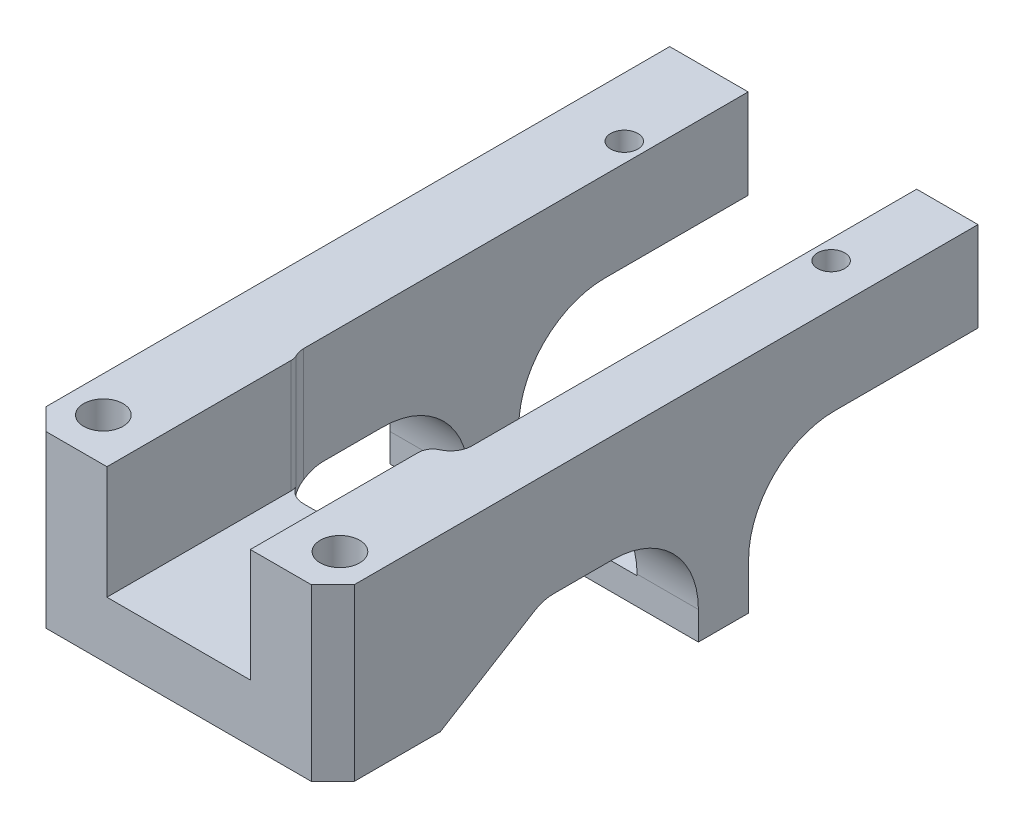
ISO-10303-21;
HEADER;
FILE_DESCRIPTION(('STEP AP214'),'2;1');
FILE_NAME('part.step','',(''),(''),'','','');
FILE_SCHEMA(('AUTOMOTIVE_DESIGN { 1 0 10303 214 1 1 1 1 }'));
ENDSEC;
DATA;
#1=APPLICATION_CONTEXT('core data for automotive mechanical design processes');
#2=APPLICATION_PROTOCOL_DEFINITION('international standard','automotive_design',2000,#1);
#3=PRODUCT_CONTEXT('',#1,'mechanical');
#4=PRODUCT('Part','Part','',(#3));
#5=PRODUCT_RELATED_PRODUCT_CATEGORY('part','',(#4));
#6=PRODUCT_DEFINITION_FORMATION('','',#4);
#7=PRODUCT_DEFINITION_CONTEXT('part definition',#1,'design');
#8=PRODUCT_DEFINITION('design','',#6,#7);
#9=PRODUCT_DEFINITION_SHAPE('','',#8);
#10=(LENGTH_UNIT() NAMED_UNIT(*) SI_UNIT(.MILLI.,.METRE.));
#11=(NAMED_UNIT(*) PLANE_ANGLE_UNIT() SI_UNIT($,.RADIAN.));
#12=(NAMED_UNIT(*) SI_UNIT($,.STERADIAN.) SOLID_ANGLE_UNIT());
#13=UNCERTAINTY_MEASURE_WITH_UNIT(LENGTH_MEASURE(1.E-05),#10,'distance_accuracy_value','');
#14=(GEOMETRIC_REPRESENTATION_CONTEXT(3) GLOBAL_UNCERTAINTY_ASSIGNED_CONTEXT((#13)) GLOBAL_UNIT_ASSIGNED_CONTEXT((#10,
#11,#12)) REPRESENTATION_CONTEXT('',''));
#15=CARTESIAN_POINT('',(0.,0.,0.));
#16=DIRECTION('',(0.,0.,1.));
#17=DIRECTION('',(1.,0.,0.));
#18=AXIS2_PLACEMENT_3D('',#15,#16,#17);
#19=CARTESIAN_POINT('',(15.621,30.9365,-75.395));
#20=DIRECTION('',(0.,1.,0.));
#21=DIRECTION('',(0.,0.,1.));
#22=AXIS2_PLACEMENT_3D('',#19,#20,#21);
#23=CYLINDRICAL_SURFACE('',#22,1.89864999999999);
#24=CARTESIAN_POINT('',(15.621,18.4365,-75.395));
#25=DIRECTION('',(0.,1.,0.));
#26=DIRECTION('',(0.,0.,1.));
#27=AXIS2_PLACEMENT_3D('',#24,#25,#26);
#28=CIRCLE('',#27,1.89864999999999);
#29=CARTESIAN_POINT('',(15.621,18.4365,-73.49635));
#30=VERTEX_POINT('',#29);
#31=EDGE_CURVE('E20',#30,#30,#28,.F.);
#32=ORIENTED_EDGE('',*,*,#31,.T.);
#33=EDGE_LOOP('',(#32));
#34=FACE_BOUND('',#33,.T.);
#35=CARTESIAN_POINT('',(15.621,30.9365,-75.395));
#36=DIRECTION('',(0.,1.,0.));
#37=DIRECTION('',(0.,0.,1.));
#38=AXIS2_PLACEMENT_3D('',#35,#36,#37);
#39=CIRCLE('',#38,1.89864999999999);
#40=CARTESIAN_POINT('',(15.621,30.9365,-73.49635));
#41=VERTEX_POINT('',#40);
#42=EDGE_CURVE('E199',#41,#41,#39,.T.);
#43=ORIENTED_EDGE('',*,*,#42,.T.);
#44=EDGE_LOOP('',(#43));
#45=FACE_BOUND('',#44,.T.);
#46=ADVANCED_FACE('F17',(#34,#45),#23,.F.);
#47=CARTESIAN_POINT('',(10.,-24.8451211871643,-25.));
#48=DIRECTION('',(1.,0.,0.));
#49=DIRECTION('',(0.,0.,-1.));
#50=AXIS2_PLACEMENT_3D('',#47,#48,#49);
#51=PLANE('',#50);
#52=DIRECTION('',(0.,-1.,0.));
#53=VECTOR('',#52,1.);
#54=CARTESIAN_POINT('',(10.,3.73849999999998,-23.4423644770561));
#55=LINE('',#54,#53);
#56=CARTESIAN_POINT('',(10.,15.1705,-23.4423644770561));
#57=VERTEX_POINT('',#56);
#58=CARTESIAN_POINT('',(10.,30.9365,-23.4423644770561));
#59=VERTEX_POINT('',#58);
#60=EDGE_CURVE('E179',#57,#59,#55,.F.);
#61=ORIENTED_EDGE('',*,*,#60,.F.);
#62=DIRECTION('',(0.,0.,1.));
#63=VECTOR('',#62,1.);
#64=CARTESIAN_POINT('',(10.,15.1705,0.));
#65=LINE('',#64,#63);
#66=CARTESIAN_POINT('',(10.,15.1705,0.));
#67=VERTEX_POINT('',#66);
#68=EDGE_CURVE('E205',#67,#57,#65,.F.);
#69=ORIENTED_EDGE('',*,*,#68,.F.);
#70=DIRECTION('',(0.,1.,0.));
#71=VECTOR('',#70,1.);
#72=CARTESIAN_POINT('',(10.,0.,0.));
#73=LINE('',#72,#71);
#74=CARTESIAN_POINT('',(10.,30.9365,0.));
#75=VERTEX_POINT('',#74);
#76=EDGE_CURVE('E183',#67,#75,#73,.T.);
#77=ORIENTED_EDGE('',*,*,#76,.T.);
#78=DIRECTION('',(0.,0.,-1.));
#79=VECTOR('',#78,1.);
#80=CARTESIAN_POINT('',(10.,30.9365,0.));
#81=LINE('',#80,#79);
#82=EDGE_CURVE('E174',#75,#59,#81,.T.);
#83=ORIENTED_EDGE('',*,*,#82,.T.);
#84=EDGE_LOOP('',(#61,#69,#77,#83));
#85=FACE_BOUND('',#84,.T.);
#86=ADVANCED_FACE('F176',(#85),#51,.F.);
#87=CARTESIAN_POINT('',(21.5,0.,-90.));
#88=DIRECTION('',(0.,0.,1.));
#89=DIRECTION('',(1.,0.,0.));
#90=AXIS2_PLACEMENT_3D('',#87,#88,#89);
#91=PLANE('',#90);
#92=DIRECTION('',(0.,1.,0.));
#93=VECTOR('',#92,1.);
#94=CARTESIAN_POINT('',(12.9438,3.73849999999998,-90.));
#95=LINE('',#94,#93);
#96=CARTESIAN_POINT('',(12.9438,18.4365,-90.));
#97=VERTEX_POINT('',#96);
#98=CARTESIAN_POINT('',(12.9438,30.9365,-90.));
#99=VERTEX_POINT('',#98);
#100=EDGE_CURVE('E328',#97,#99,#95,.T.);
#101=ORIENTED_EDGE('',*,*,#100,.T.);
#102=DIRECTION('',(1.,0.,0.));
#103=VECTOR('',#102,1.);
#104=CARTESIAN_POINT('',(21.5,30.9365,-90.));
#105=LINE('',#104,#103);
#106=CARTESIAN_POINT('',(21.5,30.9365,-90.));
#107=VERTEX_POINT('',#106);
#108=EDGE_CURVE('E187',#99,#107,#105,.T.);
#109=ORIENTED_EDGE('',*,*,#108,.T.);
#110=DIRECTION('',(0.,1.,0.));
#111=VECTOR('',#110,1.);
#112=CARTESIAN_POINT('',(21.5,0.,-90.));
#113=LINE('',#112,#111);
#114=CARTESIAN_POINT('',(21.5,18.4365,-90.));
#115=VERTEX_POINT('',#114);
#116=EDGE_CURVE('E408',#107,#115,#113,.F.);
#117=ORIENTED_EDGE('',*,*,#116,.T.);
#118=DIRECTION('',(1.,0.,0.));
#119=VECTOR('',#118,1.);
#120=CARTESIAN_POINT('',(-21.501,18.4365,-90.));
#121=LINE('',#120,#119);
#122=EDGE_CURVE('E188',#115,#97,#121,.F.);
#123=ORIENTED_EDGE('',*,*,#122,.T.);
#124=EDGE_LOOP('',(#101,#109,#117,#123));
#125=FACE_BOUND('',#124,.T.);
#126=ADVANCED_FACE('F674',(#125),#91,.F.);
#127=CARTESIAN_POINT('',(-21.501,18.4365,-90.));
#128=DIRECTION('',(0.,1.,0.));
#129=DIRECTION('',(0.,0.,1.));
#130=AXIS2_PLACEMENT_3D('',#127,#128,#129);
#131=PLANE('',#130);
#132=DIRECTION('',(-1.,0.,0.));
#133=VECTOR('',#132,1.);
#134=CARTESIAN_POINT('',(-21.501,18.4365,-70.));
#135=LINE('',#134,#133);
#136=CARTESIAN_POINT('',(21.5,18.4365,-70.));
#137=VERTEX_POINT('',#136);
#138=CARTESIAN_POINT('',(12.9438,18.4365,-70.));
#139=VERTEX_POINT('',#138);
#140=EDGE_CURVE('E380',#137,#139,#135,.T.);
#141=ORIENTED_EDGE('',*,*,#140,.T.);
#142=DIRECTION('',(0.,0.,-1.));
#143=VECTOR('',#142,1.);
#144=CARTESIAN_POINT('',(12.9438,18.4365,-90.));
#145=LINE('',#144,#143);
#146=EDGE_CURVE('E301',#139,#97,#145,.T.);
#147=ORIENTED_EDGE('',*,*,#146,.T.);
#148=ORIENTED_EDGE('',*,*,#122,.F.);
#149=DIRECTION('',(0.,0.,1.));
#150=VECTOR('',#149,1.);
#151=CARTESIAN_POINT('',(21.5,18.4365,0.));
#152=LINE('',#151,#150);
#153=EDGE_CURVE('E292',#115,#137,#152,.T.);
#154=ORIENTED_EDGE('',*,*,#153,.T.);
#155=EDGE_LOOP('',(#141,#147,#148,#154));
#156=FACE_BOUND('',#155,.T.);
#157=ORIENTED_EDGE('',*,*,#31,.F.);
#158=EDGE_LOOP('',(#157));
#159=FACE_BOUND('',#158,.T.);
#160=ADVANCED_FACE('F679',(#156,#159),#131,.F.);
#161=CARTESIAN_POINT('',(-21.501,15.9365,-29.3625701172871));
#162=DIRECTION('',(0.,1.,0.));
#163=DIRECTION('',(0.,0.,1.));
#164=AXIS2_PLACEMENT_3D('',#161,#162,#163);
#165=PLANE('',#164);
#166=DIRECTION('',(-1.,0.,0.));
#167=VECTOR('',#166,1.);
#168=CARTESIAN_POINT('',(-21.501,15.9365,-30.7678767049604));
#169=LINE('',#168,#167);
#170=CARTESIAN_POINT('',(21.5,15.9365,-30.7678767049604));
#171=VERTEX_POINT('',#170);
#172=CARTESIAN_POINT('',(12.9438,15.9365,-30.7678767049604));
#173=VERTEX_POINT('',#172);
#174=EDGE_CURVE('E281',#171,#173,#169,.T.);
#175=ORIENTED_EDGE('',*,*,#174,.T.);
#176=DIRECTION('',(0.,0.,-1.));
#177=VECTOR('',#176,1.);
#178=CARTESIAN_POINT('',(12.9438,15.9365,-90.));
#179=LINE('',#178,#177);
#180=CARTESIAN_POINT('',(12.9438,15.9365,-39.));
#181=VERTEX_POINT('',#180);
#182=EDGE_CURVE('E404',#173,#181,#179,.T.);
#183=ORIENTED_EDGE('',*,*,#182,.T.);
#184=DIRECTION('',(-1.,0.,0.));
#185=VECTOR('',#184,1.);
#186=CARTESIAN_POINT('',(-21.501,15.9365,-39.));
#187=LINE('',#186,#185);
#188=CARTESIAN_POINT('',(21.5,15.9365,-39.));
#189=VERTEX_POINT('',#188);
#190=EDGE_CURVE('E297',#181,#189,#187,.F.);
#191=ORIENTED_EDGE('',*,*,#190,.T.);
#192=DIRECTION('',(0.,0.,1.));
#193=VECTOR('',#192,1.);
#194=CARTESIAN_POINT('',(21.5,15.9365,0.));
#195=LINE('',#194,#193);
#196=EDGE_CURVE('E289',#189,#171,#195,.T.);
#197=ORIENTED_EDGE('',*,*,#196,.T.);
#198=EDGE_LOOP('',(#175,#183,#191,#197));
#199=FACE_BOUND('',#198,.T.);
#200=ADVANCED_FACE('F583',(#199),#165,.F.);
#201=CARTESIAN_POINT('',(21.5,30.9365,0.));
#202=DIRECTION('',(0.,-1.,0.));
#203=DIRECTION('',(0.,0.,-1.));
#204=AXIS2_PLACEMENT_3D('',#201,#202,#203);
#205=PLANE('',#204);
#206=CARTESIAN_POINT('',(16.5,30.9365,-6.));
#207=DIRECTION('',(0.,1.,0.));
#208=DIRECTION('',(0.,0.,1.));
#209=AXIS2_PLACEMENT_3D('',#206,#207,#208);
#210=CIRCLE('',#209,2.74999999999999);
#211=CARTESIAN_POINT('',(16.5,30.9365,-3.25000000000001));
#212=VERTEX_POINT('',#211);
#213=EDGE_CURVE('E303',#212,#212,#210,.F.);
#214=ORIENTED_EDGE('',*,*,#213,.T.);
#215=EDGE_LOOP('',(#214));
#216=FACE_BOUND('',#215,.T.);
#217=ORIENTED_EDGE('',*,*,#42,.F.);
#218=EDGE_LOOP('',(#217));
#219=FACE_BOUND('',#218,.T.);
#220=DIRECTION('',(-0.707106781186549,0.,0.707106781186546));
#221=VECTOR('',#220,1.);
#222=CARTESIAN_POINT('',(21.5,30.9365,-2.99999999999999));
#223=LINE('',#222,#221);
#224=CARTESIAN_POINT('',(18.5,30.9365,0.));
#225=VERTEX_POINT('',#224);
#226=CARTESIAN_POINT('',(21.5,30.9365,-2.99999999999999));
#227=VERTEX_POINT('',#226);
#228=EDGE_CURVE('E306',#225,#227,#223,.F.);
#229=ORIENTED_EDGE('',*,*,#228,.T.);
#230=DIRECTION('',(0.,0.,1.));
#231=VECTOR('',#230,1.);
#232=CARTESIAN_POINT('',(21.5,30.9365,0.));
#233=LINE('',#232,#231);
#234=EDGE_CURVE('E285',#227,#107,#233,.F.);
#235=ORIENTED_EDGE('',*,*,#234,.T.);
#236=ORIENTED_EDGE('',*,*,#108,.F.);
#237=DIRECTION('',(0.,0.,-1.));
#238=VECTOR('',#237,1.);
#239=CARTESIAN_POINT('',(12.9438,30.9365,-90.));
#240=LINE('',#239,#238);
#241=CARTESIAN_POINT('',(12.9438,30.9365,-28.));
#242=VERTEX_POINT('',#241);
#243=EDGE_CURVE('E330',#99,#242,#240,.F.);
#244=ORIENTED_EDGE('',*,*,#243,.T.);
#245=CARTESIAN_POINT('',(9.94380000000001,30.9365,-28.));
#246=DIRECTION('',(0.,-1.,0.));
#247=DIRECTION('',(0.,0.,-1.));
#248=AXIS2_PLACEMENT_3D('',#245,#246,#247);
#249=CIRCLE('',#248,3.);
#250=CARTESIAN_POINT('',(11.17752,30.9365,-25.2654186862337));
#251=VERTEX_POINT('',#250);
#252=EDGE_CURVE('E196',#242,#251,#249,.T.);
#253=ORIENTED_EDGE('',*,*,#252,.T.);
#254=CARTESIAN_POINT('',(12.,30.9365,-23.4423644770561));
#255=DIRECTION('',(0.,-1.,0.));
#256=DIRECTION('',(0.,0.,-1.));
#257=AXIS2_PLACEMENT_3D('',#254,#255,#256);
#258=CIRCLE('',#257,2.);
#259=EDGE_CURVE('E192',#59,#251,#258,.T.);
#260=ORIENTED_EDGE('',*,*,#259,.F.);
#261=ORIENTED_EDGE('',*,*,#82,.F.);
#262=DIRECTION('',(-1.,0.,0.));
#263=VECTOR('',#262,1.);
#264=CARTESIAN_POINT('',(21.5,30.9365,0.));
#265=LINE('',#264,#263);
#266=EDGE_CURVE('E333',#75,#225,#265,.F.);
#267=ORIENTED_EDGE('',*,*,#266,.T.);
#268=EDGE_LOOP('',(#229,#235,#236,#244,#253,#260,#261,#267));
#269=FACE_BOUND('',#268,.T.);
#270=ADVANCED_FACE('F194',(#216,#219,#269),#205,.F.);
#271=CARTESIAN_POINT('',(12.,3.73849999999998,-23.4423644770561));
#272=DIRECTION('',(0.,-1.,0.));
#273=DIRECTION('',(0.,0.,-1.));
#274=AXIS2_PLACEMENT_3D('',#271,#272,#273);
#275=CYLINDRICAL_SURFACE('',#274,2.);
#276=CARTESIAN_POINT('',(12.,15.1705,-23.4423644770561));
#277=DIRECTION('',(0.,-1.,0.));
#278=DIRECTION('',(0.,0.,-1.));
#279=AXIS2_PLACEMENT_3D('',#276,#277,#278);
#280=CIRCLE('',#279,2.);
#281=CARTESIAN_POINT('',(11.17752,15.1705,-25.2654186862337));
#282=VERTEX_POINT('',#281);
#283=EDGE_CURVE('E203',#57,#282,#280,.T.);
#284=ORIENTED_EDGE('',*,*,#283,.F.);
#285=ORIENTED_EDGE('',*,*,#60,.T.);
#286=ORIENTED_EDGE('',*,*,#259,.T.);
#287=DIRECTION('',(0.,-1.,0.));
#288=VECTOR('',#287,1.);
#289=CARTESIAN_POINT('',(11.17752,3.73849999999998,-25.2654186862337));
#290=LINE('',#289,#288);
#291=EDGE_CURVE('E275',#251,#282,#290,.T.);
#292=ORIENTED_EDGE('',*,*,#291,.T.);
#293=EDGE_LOOP('',(#284,#285,#286,#292));
#294=FACE_BOUND('',#293,.T.);
#295=ADVANCED_FACE('F201',(#294),#275,.T.);
#296=CARTESIAN_POINT('',(-21.501,15.1705,0.));
#297=DIRECTION('',(0.,1.,0.));
#298=DIRECTION('',(0.,0.,1.));
#299=AXIS2_PLACEMENT_3D('',#296,#297,#298);
#300=PLANE('',#299);
#301=CARTESIAN_POINT('',(-7.55619999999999,15.1705,-28.));
#302=DIRECTION('',(0.,-1.,0.));
#303=DIRECTION('',(0.,0.,-1.));
#304=AXIS2_PLACEMENT_3D('',#301,#302,#303);
#305=CIRCLE('',#304,3.);
#306=CARTESIAN_POINT('',(-7.55619999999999,15.1705,-25.));
#307=VERTEX_POINT('',#306);
#308=CARTESIAN_POINT('',(-10.22248,15.1705,-26.6248814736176));
#309=VERTEX_POINT('',#308);
#310=EDGE_CURVE('E269',#307,#309,#305,.T.);
#311=ORIENTED_EDGE('',*,*,#310,.T.);
#312=CARTESIAN_POINT('',(-12.,15.1705,-25.7081357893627));
#313=DIRECTION('',(0.,-1.,0.));
#314=DIRECTION('',(0.,0.,-1.));
#315=AXIS2_PLACEMENT_3D('',#312,#313,#314);
#316=CIRCLE('',#315,2.);
#317=CARTESIAN_POINT('',(-9.99999999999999,15.1705,-25.7081357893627));
#318=VERTEX_POINT('',#317);
#319=EDGE_CURVE('E309',#318,#309,#316,.F.);
#320=ORIENTED_EDGE('',*,*,#319,.F.);
#321=DIRECTION('',(0.,0.,1.));
#322=VECTOR('',#321,1.);
#323=CARTESIAN_POINT('',(-9.99999999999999,15.1705,-25.));
#324=LINE('',#323,#322);
#325=CARTESIAN_POINT('',(-9.99999999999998,15.1705,0.));
#326=VERTEX_POINT('',#325);
#327=EDGE_CURVE('E346',#318,#326,#324,.T.);
#328=ORIENTED_EDGE('',*,*,#327,.T.);
#329=DIRECTION('',(-1.,0.,0.));
#330=VECTOR('',#329,1.);
#331=CARTESIAN_POINT('',(21.5,15.1705,0.));
#332=LINE('',#331,#330);
#333=EDGE_CURVE('E339',#326,#67,#332,.F.);
#334=ORIENTED_EDGE('',*,*,#333,.T.);
#335=ORIENTED_EDGE('',*,*,#68,.T.);
#336=ORIENTED_EDGE('',*,*,#283,.T.);
#337=CARTESIAN_POINT('',(9.94380000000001,15.1705,-28.));
#338=DIRECTION('',(0.,-1.,0.));
#339=DIRECTION('',(0.,0.,-1.));
#340=AXIS2_PLACEMENT_3D('',#337,#338,#339);
#341=CIRCLE('',#340,3.);
#342=CARTESIAN_POINT('',(9.94380000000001,15.1705,-25.));
#343=VERTEX_POINT('',#342);
#344=EDGE_CURVE('E272',#282,#343,#341,.T.);
#345=ORIENTED_EDGE('',*,*,#344,.T.);
#346=DIRECTION('',(1.,0.,0.));
#347=VECTOR('',#346,1.);
#348=CARTESIAN_POINT('',(-10.5562,15.1705,-25.));
#349=LINE('',#348,#347);
#350=EDGE_CURVE('E385',#343,#307,#349,.F.);
#351=ORIENTED_EDGE('',*,*,#350,.T.);
#352=EDGE_LOOP('',(#311,#320,#328,#334,#335,#336,#345,#351));
#353=FACE_BOUND('',#352,.T.);
#354=ADVANCED_FACE('F776',(#353),#300,.T.);
#355=CARTESIAN_POINT('',(-12.,3.73849999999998,-25.7081357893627));
#356=DIRECTION('',(0.,-1.,0.));
#357=DIRECTION('',(0.,0.,-1.));
#358=AXIS2_PLACEMENT_3D('',#355,#356,#357);
#359=CYLINDRICAL_SURFACE('',#358,2.);
#360=CARTESIAN_POINT('',(-12.,30.9365,-25.7081357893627));
#361=DIRECTION('',(0.,-1.,0.));
#362=DIRECTION('',(0.,0.,-1.));
#363=AXIS2_PLACEMENT_3D('',#360,#361,#362);
#364=CIRCLE('',#363,2.);
#365=CARTESIAN_POINT('',(-10.22248,30.9365,-26.6248814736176));
#366=VERTEX_POINT('',#365);
#367=CARTESIAN_POINT('',(-9.99999999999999,30.9365,-25.7081357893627));
#368=VERTEX_POINT('',#367);
#369=EDGE_CURVE('E307',#366,#368,#364,.T.);
#370=ORIENTED_EDGE('',*,*,#369,.T.);
#371=DIRECTION('',(0.,1.,0.));
#372=VECTOR('',#371,1.);
#373=CARTESIAN_POINT('',(-9.99999999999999,-24.8451211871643,-25.7081357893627));
#374=LINE('',#373,#372);
#375=EDGE_CURVE('E348',#368,#318,#374,.F.);
#376=ORIENTED_EDGE('',*,*,#375,.T.);
#377=ORIENTED_EDGE('',*,*,#319,.T.);
#378=DIRECTION('',(0.,-1.,0.));
#379=VECTOR('',#378,1.);
#380=CARTESIAN_POINT('',(-10.22248,3.73849999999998,-26.6248814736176));
#381=LINE('',#380,#379);
#382=EDGE_CURVE('E268',#309,#366,#381,.F.);
#383=ORIENTED_EDGE('',*,*,#382,.T.);
#384=EDGE_LOOP('',(#370,#376,#377,#383));
#385=FACE_BOUND('',#384,.T.);
#386=ADVANCED_FACE('F1020',(#385),#359,.T.);
#387=CARTESIAN_POINT('',(16.5,30.9365,-6.));
#388=DIRECTION('',(0.,1.,0.));
#389=DIRECTION('',(0.,0.,1.));
#390=AXIS2_PLACEMENT_3D('',#387,#388,#389);
#391=CYLINDRICAL_SURFACE('',#390,2.74999999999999);
#392=CARTESIAN_POINT('',(16.5,7.17049999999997,-6.));
#393=DIRECTION('',(0.,1.,0.));
#394=DIRECTION('',(0.,0.,1.));
#395=AXIS2_PLACEMENT_3D('',#392,#393,#394);
#396=CIRCLE('',#395,2.74999999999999);
#397=CARTESIAN_POINT('',(16.5,7.17049999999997,-3.25000000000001));
#398=VERTEX_POINT('',#397);
#399=EDGE_CURVE('E261',#398,#398,#396,.F.);
#400=ORIENTED_EDGE('',*,*,#399,.T.);
#401=EDGE_LOOP('',(#400));
#402=FACE_BOUND('',#401,.T.);
#403=ORIENTED_EDGE('',*,*,#213,.F.);
#404=EDGE_LOOP('',(#403));
#405=FACE_BOUND('',#404,.T.);
#406=ADVANCED_FACE('F1012',(#402,#405),#391,.F.);
#407=CARTESIAN_POINT('',(21.5,0.,-2.99999999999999));
#408=DIRECTION('',(-0.707106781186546,0.,-0.707106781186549));
#409=DIRECTION('',(-0.707106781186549,0.,0.707106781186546));
#410=AXIS2_PLACEMENT_3D('',#407,#408,#409);
#411=PLANE('',#410);
#412=DIRECTION('',(0.,1.,0.));
#413=VECTOR('',#412,1.);
#414=CARTESIAN_POINT('',(18.5,0.,0.));
#415=LINE('',#414,#413);
#416=CARTESIAN_POINT('',(18.5,7.17049999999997,0.));
#417=VERTEX_POINT('',#416);
#418=EDGE_CURVE('E335',#225,#417,#415,.F.);
#419=ORIENTED_EDGE('',*,*,#418,.T.);
#420=DIRECTION('',(0.707106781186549,0.,-0.707106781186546));
#421=VECTOR('',#420,1.);
#422=CARTESIAN_POINT('',(18.5,7.17049999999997,0.));
#423=LINE('',#422,#421);
#424=CARTESIAN_POINT('',(21.5,7.17049999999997,-2.99999999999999));
#425=VERTEX_POINT('',#424);
#426=EDGE_CURVE('E365',#417,#425,#423,.T.);
#427=ORIENTED_EDGE('',*,*,#426,.T.);
#428=DIRECTION('',(0.,1.,0.));
#429=VECTOR('',#428,1.);
#430=CARTESIAN_POINT('',(21.5,0.,-2.99999999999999));
#431=LINE('',#430,#429);
#432=EDGE_CURVE('E368',#425,#227,#431,.T.);
#433=ORIENTED_EDGE('',*,*,#432,.T.);
#434=ORIENTED_EDGE('',*,*,#228,.F.);
#435=EDGE_LOOP('',(#419,#427,#433,#434));
#436=FACE_BOUND('',#435,.T.);
#437=ADVANCED_FACE('F781',(#436),#411,.F.);
#438=CARTESIAN_POINT('',(-9.99999999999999,-24.8451211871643,-25.));
#439=DIRECTION('',(-1.,0.,0.));
#440=DIRECTION('',(0.,0.,1.));
#441=AXIS2_PLACEMENT_3D('',#438,#439,#440);
#442=PLANE('',#441);
#443=ORIENTED_EDGE('',*,*,#375,.F.);
#444=DIRECTION('',(0.,0.,-1.));
#445=VECTOR('',#444,1.);
#446=CARTESIAN_POINT('',(-9.99999999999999,30.9365,0.));
#447=LINE('',#446,#445);
#448=CARTESIAN_POINT('',(-9.99999999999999,30.9365,0.));
#449=VERTEX_POINT('',#448);
#450=EDGE_CURVE('E259',#368,#449,#447,.F.);
#451=ORIENTED_EDGE('',*,*,#450,.T.);
#452=DIRECTION('',(0.,1.,0.));
#453=VECTOR('',#452,1.);
#454=CARTESIAN_POINT('',(-9.99999999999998,0.,0.));
#455=LINE('',#454,#453);
#456=EDGE_CURVE('E344',#449,#326,#455,.F.);
#457=ORIENTED_EDGE('',*,*,#456,.T.);
#458=ORIENTED_EDGE('',*,*,#327,.F.);
#459=EDGE_LOOP('',(#443,#451,#457,#458));
#460=FACE_BOUND('',#459,.T.);
#461=ADVANCED_FACE('F997',(#460),#442,.F.);
#462=CARTESIAN_POINT('',(21.5,0.,0.));
#463=DIRECTION('',(0.,0.,-1.));
#464=DIRECTION('',(-1.,0.,0.));
#465=AXIS2_PLACEMENT_3D('',#462,#463,#464);
#466=PLANE('',#465);
#467=ORIENTED_EDGE('',*,*,#418,.F.);
#468=ORIENTED_EDGE('',*,*,#266,.F.);
#469=ORIENTED_EDGE('',*,*,#76,.F.);
#470=ORIENTED_EDGE('',*,*,#333,.F.);
#471=ORIENTED_EDGE('',*,*,#456,.F.);
#472=DIRECTION('',(1.,0.,0.));
#473=VECTOR('',#472,1.);
#474=CARTESIAN_POINT('',(21.5,30.9365,0.));
#475=LINE('',#474,#473);
#476=CARTESIAN_POINT('',(-18.5,30.9365,0.));
#477=VERTEX_POINT('',#476);
#478=EDGE_CURVE('E497',#449,#477,#475,.F.);
#479=ORIENTED_EDGE('',*,*,#478,.T.);
#480=DIRECTION('',(0.,1.,0.));
#481=VECTOR('',#480,1.);
#482=CARTESIAN_POINT('',(-18.5,0.,0.));
#483=LINE('',#482,#481);
#484=CARTESIAN_POINT('',(-18.5,7.17049999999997,0.));
#485=VERTEX_POINT('',#484);
#486=EDGE_CURVE('E491',#485,#477,#483,.T.);
#487=ORIENTED_EDGE('',*,*,#486,.F.);
#488=DIRECTION('',(1.,0.,0.));
#489=VECTOR('',#488,1.);
#490=CARTESIAN_POINT('',(-21.501,7.17049999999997,0.));
#491=LINE('',#490,#489);
#492=EDGE_CURVE('E264',#485,#417,#491,.T.);
#493=ORIENTED_EDGE('',*,*,#492,.T.);
#494=EDGE_LOOP('',(#467,#468,#469,#470,#471,#479,#487,#493));
#495=FACE_BOUND('',#494,.T.);
#496=ADVANCED_FACE('F779',(#495),#466,.F.);
#497=CARTESIAN_POINT('',(-16.5,30.9365,-6.00000000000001));
#498=DIRECTION('',(0.,1.,0.));
#499=DIRECTION('',(0.,0.,1.));
#500=AXIS2_PLACEMENT_3D('',#497,#498,#499);
#501=CYLINDRICAL_SURFACE('',#500,2.74999999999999);
#502=CARTESIAN_POINT('',(-16.5,7.17049999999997,-6.00000000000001));
#503=DIRECTION('',(0.,1.,0.));
#504=DIRECTION('',(0.,0.,1.));
#505=AXIS2_PLACEMENT_3D('',#502,#503,#504);
#506=CIRCLE('',#505,2.74999999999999);
#507=CARTESIAN_POINT('',(-16.5,7.17049999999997,-3.25000000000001));
#508=VERTEX_POINT('',#507);
#509=EDGE_CURVE('E265',#508,#508,#506,.F.);
#510=ORIENTED_EDGE('',*,*,#509,.T.);
#511=EDGE_LOOP('',(#510));
#512=FACE_BOUND('',#511,.T.);
#513=CARTESIAN_POINT('',(-16.5,30.9365,-6.00000000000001));
#514=DIRECTION('',(0.,1.,0.));
#515=DIRECTION('',(0.,0.,1.));
#516=AXIS2_PLACEMENT_3D('',#513,#514,#515);
#517=CIRCLE('',#516,2.74999999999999);
#518=CARTESIAN_POINT('',(-16.5,30.9365,-3.25000000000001));
#519=VERTEX_POINT('',#518);
#520=EDGE_CURVE('E248',#519,#519,#517,.T.);
#521=ORIENTED_EDGE('',*,*,#520,.T.);
#522=EDGE_LOOP('',(#521));
#523=FACE_BOUND('',#522,.T.);
#524=ADVANCED_FACE('F980',(#512,#523),#501,.F.);
#525=CARTESIAN_POINT('',(-13.2334,30.9365,-75.395));
#526=DIRECTION('',(0.,1.,0.));
#527=DIRECTION('',(0.,0.,1.));
#528=AXIS2_PLACEMENT_3D('',#525,#526,#527);
#529=CYLINDRICAL_SURFACE('',#528,1.89864999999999);
#530=CARTESIAN_POINT('',(-13.2334,18.4365,-75.395));
#531=DIRECTION('',(0.,1.,0.));
#532=DIRECTION('',(0.,0.,1.));
#533=AXIS2_PLACEMENT_3D('',#530,#531,#532);
#534=CIRCLE('',#533,1.89864999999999);
#535=CARTESIAN_POINT('',(-13.2334,18.4365,-73.49635));
#536=VERTEX_POINT('',#535);
#537=EDGE_CURVE('E243',#536,#536,#534,.F.);
#538=ORIENTED_EDGE('',*,*,#537,.T.);
#539=EDGE_LOOP('',(#538));
#540=FACE_BOUND('',#539,.T.);
#541=CARTESIAN_POINT('',(-13.2334,30.9365,-75.395));
#542=DIRECTION('',(0.,1.,0.));
#543=DIRECTION('',(0.,0.,1.));
#544=AXIS2_PLACEMENT_3D('',#541,#542,#543);
#545=CIRCLE('',#544,1.89864999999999);
#546=CARTESIAN_POINT('',(-13.2334,30.9365,-73.49635));
#547=VERTEX_POINT('',#546);
#548=EDGE_CURVE('E252',#547,#547,#545,.T.);
#549=ORIENTED_EDGE('',*,*,#548,.T.);
#550=EDGE_LOOP('',(#549));
#551=FACE_BOUND('',#550,.T.);
#552=ADVANCED_FACE('F972',(#540,#551),#529,.F.);
#553=CARTESIAN_POINT('',(-21.501,6.43650000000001,-70.));
#554=DIRECTION('',(-1.,0.,0.));
#555=DIRECTION('',(0.,0.,1.));
#556=AXIS2_PLACEMENT_3D('',#553,#554,#555);
#557=CYLINDRICAL_SURFACE('',#556,12.);
#558=ORIENTED_EDGE('',*,*,#140,.F.);
#559=CARTESIAN_POINT('',(21.5,6.43650000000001,-70.));
#560=DIRECTION('',(-1.,0.,0.));
#561=DIRECTION('',(0.,0.,1.));
#562=AXIS2_PLACEMENT_3D('',#559,#560,#561);
#563=CIRCLE('',#562,12.);
#564=CARTESIAN_POINT('',(21.5,6.43650000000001,-58.));
#565=VERTEX_POINT('',#564);
#566=EDGE_CURVE('E290',#137,#565,#563,.F.);
#567=ORIENTED_EDGE('',*,*,#566,.T.);
#568=DIRECTION('',(1.,0.,0.));
#569=VECTOR('',#568,1.);
#570=CARTESIAN_POINT('',(-21.501,6.43650000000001,-58.));
#571=LINE('',#570,#569);
#572=CARTESIAN_POINT('',(12.9438,6.43650000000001,-58.));
#573=VERTEX_POINT('',#572);
#574=EDGE_CURVE('E455',#565,#573,#571,.F.);
#575=ORIENTED_EDGE('',*,*,#574,.T.);
#576=CARTESIAN_POINT('',(12.9438,6.43650000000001,-70.));
#577=DIRECTION('',(-1.,0.,0.));
#578=DIRECTION('',(0.,0.,1.));
#579=AXIS2_PLACEMENT_3D('',#576,#577,#578);
#580=CIRCLE('',#579,12.);
#581=EDGE_CURVE('E298',#573,#139,#580,.T.);
#582=ORIENTED_EDGE('',*,*,#581,.T.);
#583=EDGE_LOOP('',(#558,#567,#575,#582));
#584=FACE_BOUND('',#583,.T.);
#585=ADVANCED_FACE('F690',(#584),#557,.F.);
#586=CARTESIAN_POINT('',(12.9438,3.73849999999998,-90.));
#587=DIRECTION('',(1.,0.,0.));
#588=DIRECTION('',(0.,0.,-1.));
#589=AXIS2_PLACEMENT_3D('',#586,#587,#588);
#590=PLANE('',#589);
#591=DIRECTION('',(0.,-1.,0.));
#592=VECTOR('',#591,1.);
#593=CARTESIAN_POINT('',(12.9438,3.73849999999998,-28.));
#594=LINE('',#593,#592);
#595=CARTESIAN_POINT('',(12.9438,15.1048737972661,-28.));
#596=VERTEX_POINT('',#595);
#597=EDGE_CURVE('E277',#596,#242,#594,.F.);
#598=ORIENTED_EDGE('',*,*,#597,.T.);
#599=ORIENTED_EDGE('',*,*,#243,.F.);
#600=ORIENTED_EDGE('',*,*,#100,.F.);
#601=ORIENTED_EDGE('',*,*,#146,.F.);
#602=ORIENTED_EDGE('',*,*,#581,.F.);
#603=DIRECTION('',(0.,1.,0.));
#604=VECTOR('',#603,1.);
#605=CARTESIAN_POINT('',(12.9438,0.,-58.));
#606=LINE('',#605,#604);
#607=CARTESIAN_POINT('',(12.9438,3.73849999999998,-58.));
#608=VERTEX_POINT('',#607);
#609=EDGE_CURVE('E465',#573,#608,#606,.F.);
#610=ORIENTED_EDGE('',*,*,#609,.T.);
#611=DIRECTION('',(0.,0.,1.));
#612=VECTOR('',#611,1.);
#613=CARTESIAN_POINT('',(12.9438,3.73849999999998,0.));
#614=LINE('',#613,#612);
#615=CARTESIAN_POINT('',(12.9438,3.73849999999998,-51.));
#616=VERTEX_POINT('',#615);
#617=EDGE_CURVE('E402',#616,#608,#614,.F.);
#618=ORIENTED_EDGE('',*,*,#617,.F.);
#619=DIRECTION('',(0.,1.,0.));
#620=VECTOR('',#619,1.);
#621=CARTESIAN_POINT('',(12.9438,3.73849999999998,-51.));
#622=LINE('',#621,#620);
#623=CARTESIAN_POINT('',(12.9438,3.93650000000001,-51.));
#624=VERTEX_POINT('',#623);
#625=EDGE_CURVE('E302',#624,#616,#622,.F.);
#626=ORIENTED_EDGE('',*,*,#625,.F.);
#627=CARTESIAN_POINT('',(12.9438,3.93650000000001,-39.));
#628=DIRECTION('',(-1.,0.,0.));
#629=DIRECTION('',(0.,0.,1.));
#630=AXIS2_PLACEMENT_3D('',#627,#628,#629);
#631=CIRCLE('',#630,12.);
#632=EDGE_CURVE('E293',#624,#181,#631,.F.);
#633=ORIENTED_EDGE('',*,*,#632,.T.);
#634=ORIENTED_EDGE('',*,*,#182,.F.);
#635=CARTESIAN_POINT('',(12.9438,10.9365,-30.7678767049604));
#636=DIRECTION('',(-1.,0.,0.));
#637=DIRECTION('',(0.,0.,1.));
#638=AXIS2_PLACEMENT_3D('',#635,#636,#637);
#639=CIRCLE('',#638,5.);
#640=CARTESIAN_POINT('',(12.9438,15.2043795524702,-28.1630342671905));
#641=VERTEX_POINT('',#640);
#642=EDGE_CURVE('E278',#173,#641,#639,.F.);
#643=ORIENTED_EDGE('',*,*,#642,.T.);
#644=DIRECTION('',(0.,0.520968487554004,-0.853575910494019));
#645=VECTOR('',#644,1.);
#646=CARTESIAN_POINT('',(12.9438,15.1048737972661,-28.));
#647=LINE('',#646,#645);
#648=EDGE_CURVE('E392',#596,#641,#647,.T.);
#649=ORIENTED_EDGE('',*,*,#648,.F.);
#650=EDGE_LOOP('',(#598,#599,#600,#601,#602,#610,#618,#626,#633,#634,#643,#649));
#651=FACE_BOUND('',#650,.T.);
#652=ADVANCED_FACE('F685',(#651),#590,.F.);
#653=CARTESIAN_POINT('',(0.,3.73849999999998,0.));
#654=DIRECTION('',(0.,1.,0.));
#655=DIRECTION('',(0.,0.,1.));
#656=AXIS2_PLACEMENT_3D('',#653,#654,#655);
#657=PLANE('',#656);
#658=DIRECTION('',(1.,0.,0.));
#659=VECTOR('',#658,1.);
#660=CARTESIAN_POINT('',(-21.501,3.73849999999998,-58.));
#661=LINE('',#660,#659);
#662=CARTESIAN_POINT('',(-10.5562,3.73849999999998,-58.));
#663=VERTEX_POINT('',#662);
#664=EDGE_CURVE('E460',#608,#663,#661,.F.);
#665=ORIENTED_EDGE('',*,*,#664,.T.);
#666=DIRECTION('',(0.,0.,1.));
#667=VECTOR('',#666,1.);
#668=CARTESIAN_POINT('',(-10.5562,3.73849999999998,-90.));
#669=LINE('',#668,#667);
#670=CARTESIAN_POINT('',(-10.5562,3.73849999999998,-51.));
#671=VERTEX_POINT('',#670);
#672=EDGE_CURVE('E296',#663,#671,#669,.T.);
#673=ORIENTED_EDGE('',*,*,#672,.T.);
#674=DIRECTION('',(1.,0.,0.));
#675=VECTOR('',#674,1.);
#676=CARTESIAN_POINT('',(-21.501,3.73849999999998,-51.));
#677=LINE('',#676,#675);
#678=EDGE_CURVE('E429',#671,#616,#677,.T.);
#679=ORIENTED_EDGE('',*,*,#678,.T.);
#680=ORIENTED_EDGE('',*,*,#617,.T.);
#681=EDGE_LOOP('',(#665,#673,#679,#680));
#682=FACE_BOUND('',#681,.T.);
#683=ADVANCED_FACE('F699',(#682),#657,.T.);
#684=CARTESIAN_POINT('',(-21.501,3.93650000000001,-39.));
#685=DIRECTION('',(-1.,0.,0.));
#686=DIRECTION('',(0.,0.,1.));
#687=AXIS2_PLACEMENT_3D('',#684,#685,#686);
#688=CYLINDRICAL_SURFACE('',#687,12.);
#689=DIRECTION('',(1.,0.,0.));
#690=VECTOR('',#689,1.);
#691=CARTESIAN_POINT('',(-21.501,3.93650000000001,-51.));
#692=LINE('',#691,#690);
#693=CARTESIAN_POINT('',(21.5,3.93650000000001,-51.));
#694=VERTEX_POINT('',#693);
#695=EDGE_CURVE('E432',#624,#694,#692,.T.);
#696=ORIENTED_EDGE('',*,*,#695,.T.);
#697=CARTESIAN_POINT('',(21.5,3.93650000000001,-39.));
#698=DIRECTION('',(-1.,0.,0.));
#699=DIRECTION('',(0.,0.,1.));
#700=AXIS2_PLACEMENT_3D('',#697,#698,#699);
#701=CIRCLE('',#700,12.);
#702=EDGE_CURVE('E286',#694,#189,#701,.F.);
#703=ORIENTED_EDGE('',*,*,#702,.T.);
#704=ORIENTED_EDGE('',*,*,#190,.F.);
#705=ORIENTED_EDGE('',*,*,#632,.F.);
#706=EDGE_LOOP('',(#696,#703,#704,#705));
#707=FACE_BOUND('',#706,.T.);
#708=ADVANCED_FACE('F588',(#707),#688,.F.);
#709=CARTESIAN_POINT('',(-10.5562,3.73849999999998,-90.));
#710=DIRECTION('',(-1.,0.,0.));
#711=DIRECTION('',(0.,0.,1.));
#712=AXIS2_PLACEMENT_3D('',#709,#710,#711);
#713=PLANE('',#712);
#714=DIRECTION('',(0.,-1.,0.));
#715=VECTOR('',#714,1.);
#716=CARTESIAN_POINT('',(-10.5562,3.73849999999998,-28.));
#717=LINE('',#716,#715);
#718=CARTESIAN_POINT('',(-10.5562,30.9365,-28.));
#719=VERTEX_POINT('',#718);
#720=CARTESIAN_POINT('',(-10.5562,15.1048737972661,-28.));
#721=VERTEX_POINT('',#720);
#722=EDGE_CURVE('E387',#719,#721,#717,.T.);
#723=ORIENTED_EDGE('',*,*,#722,.T.);
#724=DIRECTION('',(0.,-0.520968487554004,0.853575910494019));
#725=VECTOR('',#724,1.);
#726=CARTESIAN_POINT('',(-10.5562,15.2043795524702,-28.1630342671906));
#727=LINE('',#726,#725);
#728=CARTESIAN_POINT('',(-10.5562,15.2043795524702,-28.1630342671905));
#729=VERTEX_POINT('',#728);
#730=EDGE_CURVE('E409',#729,#721,#727,.T.);
#731=ORIENTED_EDGE('',*,*,#730,.F.);
#732=CARTESIAN_POINT('',(-10.5562,10.9365,-30.7678767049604));
#733=DIRECTION('',(-1.,0.,0.));
#734=DIRECTION('',(0.,0.,1.));
#735=AXIS2_PLACEMENT_3D('',#732,#733,#734);
#736=CIRCLE('',#735,5.);
#737=CARTESIAN_POINT('',(-10.5562,15.9365,-30.7678767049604));
#738=VERTEX_POINT('',#737);
#739=EDGE_CURVE('E231',#729,#738,#736,.T.);
#740=ORIENTED_EDGE('',*,*,#739,.T.);
#741=DIRECTION('',(0.,0.,1.));
#742=VECTOR('',#741,1.);
#743=CARTESIAN_POINT('',(-10.5562,15.9365,-29.3625701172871));
#744=LINE('',#743,#742);
#745=CARTESIAN_POINT('',(-10.5562,15.9365,-39.));
#746=VERTEX_POINT('',#745);
#747=EDGE_CURVE('E234',#738,#746,#744,.F.);
#748=ORIENTED_EDGE('',*,*,#747,.T.);
#749=CARTESIAN_POINT('',(-10.5562,3.93650000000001,-39.));
#750=DIRECTION('',(-1.,0.,0.));
#751=DIRECTION('',(0.,0.,1.));
#752=AXIS2_PLACEMENT_3D('',#749,#750,#751);
#753=CIRCLE('',#752,12.);
#754=CARTESIAN_POINT('',(-10.5562,3.93650000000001,-51.));
#755=VERTEX_POINT('',#754);
#756=EDGE_CURVE('E235',#746,#755,#753,.T.);
#757=ORIENTED_EDGE('',*,*,#756,.T.);
#758=DIRECTION('',(0.,1.,0.));
#759=VECTOR('',#758,1.);
#760=CARTESIAN_POINT('',(-10.5562,15.9365,-51.));
#761=LINE('',#760,#759);
#762=EDGE_CURVE('E238',#755,#671,#761,.F.);
#763=ORIENTED_EDGE('',*,*,#762,.T.);
#764=ORIENTED_EDGE('',*,*,#672,.F.);
#765=DIRECTION('',(0.,1.,0.));
#766=VECTOR('',#765,1.);
#767=CARTESIAN_POINT('',(-10.5562,0.,-58.));
#768=LINE('',#767,#766);
#769=CARTESIAN_POINT('',(-10.5562,6.43650000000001,-58.));
#770=VERTEX_POINT('',#769);
#771=EDGE_CURVE('E458',#663,#770,#768,.T.);
#772=ORIENTED_EDGE('',*,*,#771,.T.);
#773=CARTESIAN_POINT('',(-10.5562,6.43650000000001,-70.));
#774=DIRECTION('',(-1.,0.,0.));
#775=DIRECTION('',(0.,0.,1.));
#776=AXIS2_PLACEMENT_3D('',#773,#774,#775);
#777=CIRCLE('',#776,12.);
#778=CARTESIAN_POINT('',(-10.5562,18.4365,-70.));
#779=VERTEX_POINT('',#778);
#780=EDGE_CURVE('E239',#770,#779,#777,.T.);
#781=ORIENTED_EDGE('',*,*,#780,.T.);
#782=DIRECTION('',(0.,0.,1.));
#783=VECTOR('',#782,1.);
#784=CARTESIAN_POINT('',(-10.5562,18.4365,-90.));
#785=LINE('',#784,#783);
#786=CARTESIAN_POINT('',(-10.5562,18.4365,-90.));
#787=VERTEX_POINT('',#786);
#788=EDGE_CURVE('E242',#779,#787,#785,.F.);
#789=ORIENTED_EDGE('',*,*,#788,.T.);
#790=DIRECTION('',(0.,1.,0.));
#791=VECTOR('',#790,1.);
#792=CARTESIAN_POINT('',(-10.5562,0.,-90.));
#793=LINE('',#792,#791);
#794=CARTESIAN_POINT('',(-10.5562,30.9365,-90.));
#795=VERTEX_POINT('',#794);
#796=EDGE_CURVE('E251',#787,#795,#793,.T.);
#797=ORIENTED_EDGE('',*,*,#796,.T.);
#798=DIRECTION('',(0.,0.,-1.));
#799=VECTOR('',#798,1.);
#800=CARTESIAN_POINT('',(-10.5562,30.9365,0.));
#801=LINE('',#800,#799);
#802=EDGE_CURVE('E260',#795,#719,#801,.F.);
#803=ORIENTED_EDGE('',*,*,#802,.T.);
#804=EDGE_LOOP('',(#723,#731,#740,#748,#757,#763,#764,#772,#781,#789,#797,#803));
#805=FACE_BOUND('',#804,.T.);
#806=ADVANCED_FACE('F701',(#805),#713,.F.);
#807=CARTESIAN_POINT('',(21.5,0.,0.));
#808=DIRECTION('',(-1.,0.,0.));
#809=DIRECTION('',(0.,0.,1.));
#810=AXIS2_PLACEMENT_3D('',#807,#808,#809);
#811=PLANE('',#810);
#812=ORIENTED_EDGE('',*,*,#432,.F.);
#813=DIRECTION('',(0.,0.,1.));
#814=VECTOR('',#813,1.);
#815=CARTESIAN_POINT('',(21.5,7.17049999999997,0.));
#816=LINE('',#815,#814);
#817=CARTESIAN_POINT('',(21.5,7.17049999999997,-15.));
#818=VERTEX_POINT('',#817);
#819=EDGE_CURVE('E375',#425,#818,#816,.F.);
#820=ORIENTED_EDGE('',*,*,#819,.T.);
#821=DIRECTION('',(0.,-0.520968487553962,0.853575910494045));
#822=VECTOR('',#821,1.);
#823=CARTESIAN_POINT('',(21.5,7.17049999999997,-15.));
#824=LINE('',#823,#822);
#825=CARTESIAN_POINT('',(21.5,15.2043795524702,-28.1630342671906));
#826=VERTEX_POINT('',#825);
#827=EDGE_CURVE('E544',#818,#826,#824,.F.);
#828=ORIENTED_EDGE('',*,*,#827,.T.);
#829=CARTESIAN_POINT('',(21.5,10.9365,-30.7678767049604));
#830=DIRECTION('',(-1.,0.,0.));
#831=DIRECTION('',(0.,0.,1.));
#832=AXIS2_PLACEMENT_3D('',#829,#830,#831);
#833=CIRCLE('',#832,5.);
#834=EDGE_CURVE('E282',#826,#171,#833,.T.);
#835=ORIENTED_EDGE('',*,*,#834,.T.);
#836=ORIENTED_EDGE('',*,*,#196,.F.);
#837=ORIENTED_EDGE('',*,*,#702,.F.);
#838=DIRECTION('',(0.,1.,0.));
#839=VECTOR('',#838,1.);
#840=CARTESIAN_POINT('',(21.5,15.9365,-51.));
#841=LINE('',#840,#839);
#842=CARTESIAN_POINT('',(21.5,0.,-51.));
#843=VERTEX_POINT('',#842);
#844=EDGE_CURVE('E442',#694,#843,#841,.F.);
#845=ORIENTED_EDGE('',*,*,#844,.T.);
#846=DIRECTION('',(0.,0.,1.));
#847=VECTOR('',#846,1.);
#848=CARTESIAN_POINT('',(21.5,0.,0.));
#849=LINE('',#848,#847);
#850=CARTESIAN_POINT('',(21.5,0.,-58.));
#851=VERTEX_POINT('',#850);
#852=EDGE_CURVE('E436',#843,#851,#849,.F.);
#853=ORIENTED_EDGE('',*,*,#852,.T.);
#854=DIRECTION('',(0.,1.,0.));
#855=VECTOR('',#854,1.);
#856=CARTESIAN_POINT('',(21.5,0.,-58.));
#857=LINE('',#856,#855);
#858=EDGE_CURVE('E452',#851,#565,#857,.T.);
#859=ORIENTED_EDGE('',*,*,#858,.T.);
#860=ORIENTED_EDGE('',*,*,#566,.F.);
#861=ORIENTED_EDGE('',*,*,#153,.F.);
#862=ORIENTED_EDGE('',*,*,#116,.F.);
#863=ORIENTED_EDGE('',*,*,#234,.F.);
#864=EDGE_LOOP('',(#812,#820,#828,#835,#836,#837,#845,#853,#859,#860,#861,#862,#863));
#865=FACE_BOUND('',#864,.T.);
#866=ADVANCED_FACE('F557',(#865),#811,.F.);
#867=CARTESIAN_POINT('',(-21.501,10.9365,-30.7678767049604));
#868=DIRECTION('',(-1.,0.,0.));
#869=DIRECTION('',(0.,0.,1.));
#870=AXIS2_PLACEMENT_3D('',#867,#868,#869);
#871=CYLINDRICAL_SURFACE('',#870,5.);
#872=ORIENTED_EDGE('',*,*,#174,.F.);
#873=ORIENTED_EDGE('',*,*,#834,.F.);
#874=DIRECTION('',(1.,0.,0.));
#875=VECTOR('',#874,1.);
#876=CARTESIAN_POINT('',(-21.501,15.2043795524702,-28.1630342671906));
#877=LINE('',#876,#875);
#878=EDGE_CURVE('E230',#826,#641,#877,.F.);
#879=ORIENTED_EDGE('',*,*,#878,.T.);
#880=ORIENTED_EDGE('',*,*,#642,.F.);
#881=EDGE_LOOP('',(#872,#873,#879,#880));
#882=FACE_BOUND('',#881,.T.);
#883=ADVANCED_FACE('F578',(#882),#871,.F.);
#884=CARTESIAN_POINT('',(9.94380000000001,3.73849999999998,-28.));
#885=DIRECTION('',(0.,-1.,0.));
#886=DIRECTION('',(0.,0.,-1.));
#887=AXIS2_PLACEMENT_3D('',#884,#885,#886);
#888=CYLINDRICAL_SURFACE('',#887,3.);
#889=ORIENTED_EDGE('',*,*,#291,.F.);
#890=ORIENTED_EDGE('',*,*,#252,.F.);
#891=ORIENTED_EDGE('',*,*,#597,.F.);
#892=CARTESIAN_POINT('',(9.94380000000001,15.1048737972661,-28.));
#893=DIRECTION('',(0.,0.853575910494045,0.520968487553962));
#894=DIRECTION('',(0.,-0.520968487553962,0.853575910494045));
#895=AXIS2_PLACEMENT_3D('',#892,#893,#894);
#896=ELLIPSE('',#895,3.51462589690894,3.);
#897=CARTESIAN_POINT('',(9.94380000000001,13.2738644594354,-25.));
#898=VERTEX_POINT('',#897);
#899=EDGE_CURVE('E228',#596,#898,#896,.F.);
#900=ORIENTED_EDGE('',*,*,#899,.T.);
#901=DIRECTION('',(0.,1.,0.));
#902=VECTOR('',#901,1.);
#903=CARTESIAN_POINT('',(9.94380000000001,3.73849999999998,-25.));
#904=LINE('',#903,#902);
#905=EDGE_CURVE('E274',#898,#343,#904,.T.);
#906=ORIENTED_EDGE('',*,*,#905,.T.);
#907=ORIENTED_EDGE('',*,*,#344,.F.);
#908=EDGE_LOOP('',(#889,#890,#891,#900,#906,#907));
#909=FACE_BOUND('',#908,.T.);
#910=ADVANCED_FACE('F775',(#909),#888,.F.);
#911=CARTESIAN_POINT('',(-10.5562,3.73849999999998,-25.));
#912=DIRECTION('',(0.,0.,1.));
#913=DIRECTION('',(1.,0.,0.));
#914=AXIS2_PLACEMENT_3D('',#911,#912,#913);
#915=PLANE('',#914);
#916=DIRECTION('',(0.,-1.,0.));
#917=VECTOR('',#916,1.);
#918=CARTESIAN_POINT('',(-7.55619999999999,3.73849999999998,-25.));
#919=LINE('',#918,#917);
#920=CARTESIAN_POINT('',(-7.55619999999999,13.2738644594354,-25.));
#921=VERTEX_POINT('',#920);
#922=EDGE_CURVE('E271',#921,#307,#919,.F.);
#923=ORIENTED_EDGE('',*,*,#922,.T.);
#924=ORIENTED_EDGE('',*,*,#350,.F.);
#925=ORIENTED_EDGE('',*,*,#905,.F.);
#926=DIRECTION('',(1.,0.,0.));
#927=VECTOR('',#926,1.);
#928=CARTESIAN_POINT('',(-21.501,13.2738644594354,-25.));
#929=LINE('',#928,#927);
#930=EDGE_CURVE('E227',#898,#921,#929,.F.);
#931=ORIENTED_EDGE('',*,*,#930,.T.);
#932=EDGE_LOOP('',(#923,#924,#925,#931));
#933=FACE_BOUND('',#932,.T.);
#934=ADVANCED_FACE('F771',(#933),#915,.F.);
#935=CARTESIAN_POINT('',(-7.55619999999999,3.73849999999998,-28.));
#936=DIRECTION('',(0.,-1.,0.));
#937=DIRECTION('',(0.,0.,-1.));
#938=AXIS2_PLACEMENT_3D('',#935,#936,#937);
#939=CYLINDRICAL_SURFACE('',#938,3.);
#940=ORIENTED_EDGE('',*,*,#382,.F.);
#941=ORIENTED_EDGE('',*,*,#310,.F.);
#942=ORIENTED_EDGE('',*,*,#922,.F.);
#943=CARTESIAN_POINT('',(-7.55619999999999,15.1048737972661,-28.));
#944=DIRECTION('',(0.,0.853575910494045,0.520968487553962));
#945=DIRECTION('',(0.,-0.520968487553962,0.853575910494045));
#946=AXIS2_PLACEMENT_3D('',#943,#944,#945);
#947=ELLIPSE('',#946,3.51462589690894,3.);
#948=EDGE_CURVE('E224',#921,#721,#947,.F.);
#949=ORIENTED_EDGE('',*,*,#948,.T.);
#950=ORIENTED_EDGE('',*,*,#722,.F.);
#951=CARTESIAN_POINT('',(-7.55619999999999,30.9365,-28.));
#952=DIRECTION('',(0.,-1.,0.));
#953=DIRECTION('',(0.,0.,-1.));
#954=AXIS2_PLACEMENT_3D('',#951,#952,#953);
#955=CIRCLE('',#954,3.);
#956=EDGE_CURVE('E256',#719,#366,#955,.F.);
#957=ORIENTED_EDGE('',*,*,#956,.T.);
#958=EDGE_LOOP('',(#940,#941,#942,#949,#950,#957));
#959=FACE_BOUND('',#958,.T.);
#960=ADVANCED_FACE('F765',(#959),#939,.F.);
#961=CARTESIAN_POINT('',(-21.501,7.17049999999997,0.));
#962=DIRECTION('',(0.,1.,0.));
#963=DIRECTION('',(0.,0.,1.));
#964=AXIS2_PLACEMENT_3D('',#961,#962,#963);
#965=PLANE('',#964);
#966=ORIENTED_EDGE('',*,*,#426,.F.);
#967=ORIENTED_EDGE('',*,*,#492,.F.);
#968=DIRECTION('',(0.707106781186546,0.,0.707106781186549));
#969=VECTOR('',#968,1.);
#970=CARTESIAN_POINT('',(-18.5,7.17049999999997,0.));
#971=LINE('',#970,#969);
#972=CARTESIAN_POINT('',(-21.5,7.17049999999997,-3.00000000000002));
#973=VERTEX_POINT('',#972);
#974=EDGE_CURVE('E494',#973,#485,#971,.T.);
#975=ORIENTED_EDGE('',*,*,#974,.F.);
#976=DIRECTION('',(0.,0.,1.));
#977=VECTOR('',#976,1.);
#978=CARTESIAN_POINT('',(-21.5,7.17049999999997,0.));
#979=LINE('',#978,#977);
#980=CARTESIAN_POINT('',(-21.5,7.17049999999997,-15.));
#981=VERTEX_POINT('',#980);
#982=EDGE_CURVE('E527',#981,#973,#979,.T.);
#983=ORIENTED_EDGE('',*,*,#982,.F.);
#984=DIRECTION('',(1.,0.,0.));
#985=VECTOR('',#984,1.);
#986=CARTESIAN_POINT('',(-21.501,7.17049999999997,-15.));
#987=LINE('',#986,#985);
#988=EDGE_CURVE('E546',#981,#818,#987,.T.);
#989=ORIENTED_EDGE('',*,*,#988,.T.);
#990=ORIENTED_EDGE('',*,*,#819,.F.);
#991=EDGE_LOOP('',(#966,#967,#975,#983,#989,#990));
#992=FACE_BOUND('',#991,.T.);
#993=ORIENTED_EDGE('',*,*,#399,.F.);
#994=EDGE_LOOP('',(#993));
#995=FACE_BOUND('',#994,.T.);
#996=ORIENTED_EDGE('',*,*,#509,.F.);
#997=EDGE_LOOP('',(#996));
#998=FACE_BOUND('',#997,.T.);
#999=ADVANCED_FACE('F567',(#992,#995,#998),#965,.F.);
#1000=CARTESIAN_POINT('',(-18.5,0.,0.));
#1001=DIRECTION('',(-0.707106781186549,0.,0.707106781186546));
#1002=DIRECTION('',(0.707106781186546,0.,0.707106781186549));
#1003=AXIS2_PLACEMENT_3D('',#1000,#1001,#1002);
#1004=PLANE('',#1003);
#1005=ORIENTED_EDGE('',*,*,#974,.T.);
#1006=ORIENTED_EDGE('',*,*,#486,.T.);
#1007=DIRECTION('',(-0.707106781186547,0.,-0.707106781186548));
#1008=VECTOR('',#1007,1.);
#1009=CARTESIAN_POINT('',(-18.5,30.9365,0.));
#1010=LINE('',#1009,#1008);
#1011=CARTESIAN_POINT('',(-21.5,30.9365,-3.00000000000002));
#1012=VERTEX_POINT('',#1011);
#1013=EDGE_CURVE('E255',#477,#1012,#1010,.T.);
#1014=ORIENTED_EDGE('',*,*,#1013,.T.);
#1015=DIRECTION('',(0.,1.,0.));
#1016=VECTOR('',#1015,1.);
#1017=CARTESIAN_POINT('',(-21.5,0.,-3.00000000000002));
#1018=LINE('',#1017,#1016);
#1019=EDGE_CURVE('E523',#973,#1012,#1018,.T.);
#1020=ORIENTED_EDGE('',*,*,#1019,.F.);
#1021=EDGE_LOOP('',(#1005,#1006,#1014,#1020));
#1022=FACE_BOUND('',#1021,.T.);
#1023=ADVANCED_FACE('F782',(#1022),#1004,.T.);
#1024=CARTESIAN_POINT('',(21.5,30.9365,0.));
#1025=DIRECTION('',(0.,-1.,0.));
#1026=DIRECTION('',(0.,0.,-1.));
#1027=AXIS2_PLACEMENT_3D('',#1024,#1025,#1026);
#1028=PLANE('',#1027);
#1029=ORIENTED_EDGE('',*,*,#520,.F.);
#1030=EDGE_LOOP('',(#1029));
#1031=FACE_BOUND('',#1030,.T.);
#1032=ORIENTED_EDGE('',*,*,#548,.F.);
#1033=EDGE_LOOP('',(#1032));
#1034=FACE_BOUND('',#1033,.T.);
#1035=ORIENTED_EDGE('',*,*,#1013,.F.);
#1036=ORIENTED_EDGE('',*,*,#478,.F.);
#1037=ORIENTED_EDGE('',*,*,#450,.F.);
#1038=ORIENTED_EDGE('',*,*,#369,.F.);
#1039=ORIENTED_EDGE('',*,*,#956,.F.);
#1040=ORIENTED_EDGE('',*,*,#802,.F.);
#1041=DIRECTION('',(1.,0.,0.));
#1042=VECTOR('',#1041,1.);
#1043=CARTESIAN_POINT('',(21.5,30.9365,-90.));
#1044=LINE('',#1043,#1042);
#1045=CARTESIAN_POINT('',(-21.5,30.9365,-90.));
#1046=VERTEX_POINT('',#1045);
#1047=EDGE_CURVE('E247',#795,#1046,#1044,.F.);
#1048=ORIENTED_EDGE('',*,*,#1047,.T.);
#1049=DIRECTION('',(0.,0.,1.));
#1050=VECTOR('',#1049,1.);
#1051=CARTESIAN_POINT('',(-21.5,30.9365,0.));
#1052=LINE('',#1051,#1050);
#1053=EDGE_CURVE('E526',#1012,#1046,#1052,.F.);
#1054=ORIENTED_EDGE('',*,*,#1053,.F.);
#1055=EDGE_LOOP('',(#1035,#1036,#1037,#1038,#1039,#1040,#1048,#1054));
#1056=FACE_BOUND('',#1055,.T.);
#1057=ADVANCED_FACE('F645',(#1031,#1034,#1056),#1028,.F.);
#1058=CARTESIAN_POINT('',(21.5,0.,-90.));
#1059=DIRECTION('',(0.,0.,1.));
#1060=DIRECTION('',(1.,0.,0.));
#1061=AXIS2_PLACEMENT_3D('',#1058,#1059,#1060);
#1062=PLANE('',#1061);
#1063=ORIENTED_EDGE('',*,*,#796,.F.);
#1064=DIRECTION('',(1.,0.,0.));
#1065=VECTOR('',#1064,1.);
#1066=CARTESIAN_POINT('',(-21.501,18.4365,-90.));
#1067=LINE('',#1066,#1065);
#1068=CARTESIAN_POINT('',(-21.5,18.4365,-90.));
#1069=VERTEX_POINT('',#1068);
#1070=EDGE_CURVE('E246',#787,#1069,#1067,.F.);
#1071=ORIENTED_EDGE('',*,*,#1070,.T.);
#1072=DIRECTION('',(0.,1.,0.));
#1073=VECTOR('',#1072,1.);
#1074=CARTESIAN_POINT('',(-21.5,0.,-90.));
#1075=LINE('',#1074,#1073);
#1076=EDGE_CURVE('E625',#1046,#1069,#1075,.F.);
#1077=ORIENTED_EDGE('',*,*,#1076,.F.);
#1078=ORIENTED_EDGE('',*,*,#1047,.F.);
#1079=EDGE_LOOP('',(#1063,#1071,#1077,#1078));
#1080=FACE_BOUND('',#1079,.T.);
#1081=ADVANCED_FACE('F752',(#1080),#1062,.F.);
#1082=CARTESIAN_POINT('',(-21.501,18.4365,-90.));
#1083=DIRECTION('',(0.,1.,0.));
#1084=DIRECTION('',(0.,0.,1.));
#1085=AXIS2_PLACEMENT_3D('',#1082,#1083,#1084);
#1086=PLANE('',#1085);
#1087=DIRECTION('',(-1.,0.,0.));
#1088=VECTOR('',#1087,1.);
#1089=CARTESIAN_POINT('',(-21.501,18.4365,-70.));
#1090=LINE('',#1089,#1088);
#1091=CARTESIAN_POINT('',(-21.5,18.4365,-70.));
#1092=VERTEX_POINT('',#1091);
#1093=EDGE_CURVE('E241',#779,#1092,#1090,.T.);
#1094=ORIENTED_EDGE('',*,*,#1093,.T.);
#1095=DIRECTION('',(0.,0.,1.));
#1096=VECTOR('',#1095,1.);
#1097=CARTESIAN_POINT('',(-21.5,18.4365,0.));
#1098=LINE('',#1097,#1096);
#1099=EDGE_CURVE('E223',#1069,#1092,#1098,.T.);
#1100=ORIENTED_EDGE('',*,*,#1099,.F.);
#1101=ORIENTED_EDGE('',*,*,#1070,.F.);
#1102=ORIENTED_EDGE('',*,*,#788,.F.);
#1103=EDGE_LOOP('',(#1094,#1100,#1101,#1102));
#1104=FACE_BOUND('',#1103,.T.);
#1105=ORIENTED_EDGE('',*,*,#537,.F.);
#1106=EDGE_LOOP('',(#1105));
#1107=FACE_BOUND('',#1106,.T.);
#1108=ADVANCED_FACE('F755',(#1104,#1107),#1086,.F.);
#1109=CARTESIAN_POINT('',(-21.501,6.43650000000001,-70.));
#1110=DIRECTION('',(-1.,0.,0.));
#1111=DIRECTION('',(0.,0.,1.));
#1112=AXIS2_PLACEMENT_3D('',#1109,#1110,#1111);
#1113=CYLINDRICAL_SURFACE('',#1112,12.);
#1114=ORIENTED_EDGE('',*,*,#1093,.F.);
#1115=ORIENTED_EDGE('',*,*,#780,.F.);
#1116=DIRECTION('',(1.,0.,0.));
#1117=VECTOR('',#1116,1.);
#1118=CARTESIAN_POINT('',(-21.501,6.43650000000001,-58.));
#1119=LINE('',#1118,#1117);
#1120=CARTESIAN_POINT('',(-21.5,6.43650000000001,-58.));
#1121=VERTEX_POINT('',#1120);
#1122=EDGE_CURVE('E439',#770,#1121,#1119,.F.);
#1123=ORIENTED_EDGE('',*,*,#1122,.T.);
#1124=CARTESIAN_POINT('',(-21.5,6.43650000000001,-70.));
#1125=DIRECTION('',(-1.,0.,0.));
#1126=DIRECTION('',(0.,0.,1.));
#1127=AXIS2_PLACEMENT_3D('',#1124,#1125,#1126);
#1128=CIRCLE('',#1127,12.);
#1129=EDGE_CURVE('E219',#1092,#1121,#1128,.F.);
#1130=ORIENTED_EDGE('',*,*,#1129,.F.);
#1131=EDGE_LOOP('',(#1114,#1115,#1123,#1130));
#1132=FACE_BOUND('',#1131,.T.);
#1133=ADVANCED_FACE('F760',(#1132),#1113,.F.);
#1134=CARTESIAN_POINT('',(-21.501,0.,-58.));
#1135=DIRECTION('',(0.,0.,1.));
#1136=DIRECTION('',(1.,0.,0.));
#1137=AXIS2_PLACEMENT_3D('',#1134,#1135,#1136);
#1138=PLANE('',#1137);
#1139=ORIENTED_EDGE('',*,*,#1122,.F.);
#1140=ORIENTED_EDGE('',*,*,#771,.F.);
#1141=ORIENTED_EDGE('',*,*,#664,.F.);
#1142=ORIENTED_EDGE('',*,*,#609,.F.);
#1143=ORIENTED_EDGE('',*,*,#574,.F.);
#1144=ORIENTED_EDGE('',*,*,#858,.F.);
#1145=DIRECTION('',(1.,0.,0.));
#1146=VECTOR('',#1145,1.);
#1147=CARTESIAN_POINT('',(21.5,0.,-58.));
#1148=LINE('',#1147,#1146);
#1149=CARTESIAN_POINT('',(-21.5,0.,-58.));
#1150=VERTEX_POINT('',#1149);
#1151=EDGE_CURVE('E433',#851,#1150,#1148,.F.);
#1152=ORIENTED_EDGE('',*,*,#1151,.T.);
#1153=DIRECTION('',(0.,1.,0.));
#1154=VECTOR('',#1153,1.);
#1155=CARTESIAN_POINT('',(-21.5,0.,-58.));
#1156=LINE('',#1155,#1154);
#1157=EDGE_CURVE('E222',#1121,#1150,#1156,.F.);
#1158=ORIENTED_EDGE('',*,*,#1157,.F.);
#1159=EDGE_LOOP('',(#1139,#1140,#1141,#1142,#1143,#1144,#1152,#1158));
#1160=FACE_BOUND('',#1159,.T.);
#1161=ADVANCED_FACE('F695',(#1160),#1138,.F.);
#1162=CARTESIAN_POINT('',(21.5,0.,0.));
#1163=DIRECTION('',(0.,1.,0.));
#1164=DIRECTION('',(0.,0.,1.));
#1165=AXIS2_PLACEMENT_3D('',#1162,#1163,#1164);
#1166=PLANE('',#1165);
#1167=ORIENTED_EDGE('',*,*,#1151,.F.);
#1168=ORIENTED_EDGE('',*,*,#852,.F.);
#1169=DIRECTION('',(1.,0.,0.));
#1170=VECTOR('',#1169,1.);
#1171=CARTESIAN_POINT('',(-21.501,0.,-51.));
#1172=LINE('',#1171,#1170);
#1173=CARTESIAN_POINT('',(-21.5,0.,-51.));
#1174=VERTEX_POINT('',#1173);
#1175=EDGE_CURVE('E424',#843,#1174,#1172,.F.);
#1176=ORIENTED_EDGE('',*,*,#1175,.T.);
#1177=DIRECTION('',(0.,0.,1.));
#1178=VECTOR('',#1177,1.);
#1179=CARTESIAN_POINT('',(-21.5,0.,0.));
#1180=LINE('',#1179,#1178);
#1181=EDGE_CURVE('E606',#1150,#1174,#1180,.T.);
#1182=ORIENTED_EDGE('',*,*,#1181,.F.);
#1183=EDGE_LOOP('',(#1167,#1168,#1176,#1182));
#1184=FACE_BOUND('',#1183,.T.);
#1185=ADVANCED_FACE('F602',(#1184),#1166,.F.);
#1186=CARTESIAN_POINT('',(-21.501,15.9365,-51.));
#1187=DIRECTION('',(0.,0.,-1.));
#1188=DIRECTION('',(0.,1.,0.));
#1189=AXIS2_PLACEMENT_3D('',#1186,#1187,#1188);
#1190=PLANE('',#1189);
#1191=DIRECTION('',(-1.,0.,0.));
#1192=VECTOR('',#1191,1.);
#1193=CARTESIAN_POINT('',(-21.501,3.93650000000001,-51.));
#1194=LINE('',#1193,#1192);
#1195=CARTESIAN_POINT('',(-21.5,3.93650000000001,-51.));
#1196=VERTEX_POINT('',#1195);
#1197=EDGE_CURVE('E237',#755,#1196,#1194,.T.);
#1198=ORIENTED_EDGE('',*,*,#1197,.T.);
#1199=DIRECTION('',(0.,1.,0.));
#1200=VECTOR('',#1199,1.);
#1201=CARTESIAN_POINT('',(-21.5,0.,-51.));
#1202=LINE('',#1201,#1200);
#1203=EDGE_CURVE('E218',#1174,#1196,#1202,.T.);
#1204=ORIENTED_EDGE('',*,*,#1203,.F.);
#1205=ORIENTED_EDGE('',*,*,#1175,.F.);
#1206=ORIENTED_EDGE('',*,*,#844,.F.);
#1207=ORIENTED_EDGE('',*,*,#695,.F.);
#1208=ORIENTED_EDGE('',*,*,#625,.T.);
#1209=ORIENTED_EDGE('',*,*,#678,.F.);
#1210=ORIENTED_EDGE('',*,*,#762,.F.);
#1211=EDGE_LOOP('',(#1198,#1204,#1205,#1206,#1207,#1208,#1209,#1210));
#1212=FACE_BOUND('',#1211,.T.);
#1213=ADVANCED_FACE('F591',(#1212),#1190,.F.);
#1214=CARTESIAN_POINT('',(-21.501,3.93650000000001,-39.));
#1215=DIRECTION('',(-1.,0.,0.));
#1216=DIRECTION('',(0.,0.,1.));
#1217=AXIS2_PLACEMENT_3D('',#1214,#1215,#1216);
#1218=CYLINDRICAL_SURFACE('',#1217,12.);
#1219=ORIENTED_EDGE('',*,*,#1197,.F.);
#1220=ORIENTED_EDGE('',*,*,#756,.F.);
#1221=DIRECTION('',(1.,0.,0.));
#1222=VECTOR('',#1221,1.);
#1223=CARTESIAN_POINT('',(-21.501,15.9365,-39.));
#1224=LINE('',#1223,#1222);
#1225=CARTESIAN_POINT('',(-21.5,15.9365,-39.));
#1226=VERTEX_POINT('',#1225);
#1227=EDGE_CURVE('E710',#746,#1226,#1224,.F.);
#1228=ORIENTED_EDGE('',*,*,#1227,.T.);
#1229=CARTESIAN_POINT('',(-21.5,3.93650000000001,-39.));
#1230=DIRECTION('',(-1.,0.,0.));
#1231=DIRECTION('',(0.,0.,1.));
#1232=AXIS2_PLACEMENT_3D('',#1229,#1230,#1231);
#1233=CIRCLE('',#1232,12.);
#1234=EDGE_CURVE('E215',#1196,#1226,#1233,.F.);
#1235=ORIENTED_EDGE('',*,*,#1234,.F.);
#1236=EDGE_LOOP('',(#1219,#1220,#1228,#1235));
#1237=FACE_BOUND('',#1236,.T.);
#1238=ADVANCED_FACE('F708',(#1237),#1218,.F.);
#1239=CARTESIAN_POINT('',(-21.501,15.9365,-29.3625701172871));
#1240=DIRECTION('',(0.,1.,0.));
#1241=DIRECTION('',(0.,0.,1.));
#1242=AXIS2_PLACEMENT_3D('',#1239,#1240,#1241);
#1243=PLANE('',#1242);
#1244=DIRECTION('',(-1.,0.,0.));
#1245=VECTOR('',#1244,1.);
#1246=CARTESIAN_POINT('',(-21.501,15.9365,-30.7678767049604));
#1247=LINE('',#1246,#1245);
#1248=CARTESIAN_POINT('',(-21.5,15.9365,-30.7678767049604));
#1249=VERTEX_POINT('',#1248);
#1250=EDGE_CURVE('E233',#738,#1249,#1247,.T.);
#1251=ORIENTED_EDGE('',*,*,#1250,.T.);
#1252=DIRECTION('',(0.,0.,1.));
#1253=VECTOR('',#1252,1.);
#1254=CARTESIAN_POINT('',(-21.5,15.9365,0.));
#1255=LINE('',#1254,#1253);
#1256=EDGE_CURVE('E214',#1226,#1249,#1255,.T.);
#1257=ORIENTED_EDGE('',*,*,#1256,.F.);
#1258=ORIENTED_EDGE('',*,*,#1227,.F.);
#1259=ORIENTED_EDGE('',*,*,#747,.F.);
#1260=EDGE_LOOP('',(#1251,#1257,#1258,#1259));
#1261=FACE_BOUND('',#1260,.T.);
#1262=ADVANCED_FACE('F737',(#1261),#1243,.F.);
#1263=CARTESIAN_POINT('',(-21.501,10.9365,-30.7678767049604));
#1264=DIRECTION('',(-1.,0.,0.));
#1265=DIRECTION('',(0.,0.,1.));
#1266=AXIS2_PLACEMENT_3D('',#1263,#1264,#1265);
#1267=CYLINDRICAL_SURFACE('',#1266,5.);
#1268=ORIENTED_EDGE('',*,*,#1250,.F.);
#1269=ORIENTED_EDGE('',*,*,#739,.F.);
#1270=DIRECTION('',(1.,0.,0.));
#1271=VECTOR('',#1270,1.);
#1272=CARTESIAN_POINT('',(-21.501,15.2043795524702,-28.1630342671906));
#1273=LINE('',#1272,#1271);
#1274=CARTESIAN_POINT('',(-21.5,15.2043795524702,-28.1630342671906));
#1275=VERTEX_POINT('',#1274);
#1276=EDGE_CURVE('E35',#729,#1275,#1273,.F.);
#1277=ORIENTED_EDGE('',*,*,#1276,.T.);
#1278=CARTESIAN_POINT('',(-21.5,10.9365,-30.7678767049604));
#1279=DIRECTION('',(-1.,0.,0.));
#1280=DIRECTION('',(0.,0.,1.));
#1281=AXIS2_PLACEMENT_3D('',#1278,#1279,#1280);
#1282=CIRCLE('',#1281,5.);
#1283=EDGE_CURVE('E26',#1249,#1275,#1282,.F.);
#1284=ORIENTED_EDGE('',*,*,#1283,.F.);
#1285=EDGE_LOOP('',(#1268,#1269,#1277,#1284));
#1286=FACE_BOUND('',#1285,.T.);
#1287=ADVANCED_FACE('F740',(#1286),#1267,.F.);
#1288=CARTESIAN_POINT('',(-21.501,7.17049999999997,-15.));
#1289=DIRECTION('',(0.,0.853575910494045,0.520968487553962));
#1290=DIRECTION('',(0.,-0.520968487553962,0.853575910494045));
#1291=AXIS2_PLACEMENT_3D('',#1288,#1289,#1290);
#1292=PLANE('',#1291);
#1293=ORIENTED_EDGE('',*,*,#1276,.F.);
#1294=ORIENTED_EDGE('',*,*,#730,.T.);
#1295=ORIENTED_EDGE('',*,*,#948,.F.);
#1296=ORIENTED_EDGE('',*,*,#930,.F.);
#1297=ORIENTED_EDGE('',*,*,#899,.F.);
#1298=ORIENTED_EDGE('',*,*,#648,.T.);
#1299=ORIENTED_EDGE('',*,*,#878,.F.);
#1300=ORIENTED_EDGE('',*,*,#827,.F.);
#1301=ORIENTED_EDGE('',*,*,#988,.F.);
#1302=DIRECTION('',(0.,-0.520968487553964,0.853575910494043));
#1303=VECTOR('',#1302,1.);
#1304=CARTESIAN_POINT('',(-21.5,15.2043795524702,-28.1630342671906));
#1305=LINE('',#1304,#1303);
#1306=EDGE_CURVE('E11',#1275,#981,#1305,.T.);
#1307=ORIENTED_EDGE('',*,*,#1306,.F.);
#1308=EDGE_LOOP('',(#1293,#1294,#1295,#1296,#1297,#1298,#1299,#1300,#1301,#1307));
#1309=FACE_BOUND('',#1308,.T.);
#1310=ADVANCED_FACE('F573',(#1309),#1292,.F.);
#1311=CARTESIAN_POINT('',(-21.5,0.,0.));
#1312=DIRECTION('',(-1.,0.,0.));
#1313=DIRECTION('',(0.,0.,1.));
#1314=AXIS2_PLACEMENT_3D('',#1311,#1312,#1313);
#1315=PLANE('',#1314);
#1316=ORIENTED_EDGE('',*,*,#1283,.T.);
#1317=ORIENTED_EDGE('',*,*,#1306,.T.);
#1318=ORIENTED_EDGE('',*,*,#982,.T.);
#1319=ORIENTED_EDGE('',*,*,#1019,.T.);
#1320=ORIENTED_EDGE('',*,*,#1053,.T.);
#1321=ORIENTED_EDGE('',*,*,#1076,.T.);
#1322=ORIENTED_EDGE('',*,*,#1099,.T.);
#1323=ORIENTED_EDGE('',*,*,#1129,.T.);
#1324=ORIENTED_EDGE('',*,*,#1157,.T.);
#1325=ORIENTED_EDGE('',*,*,#1181,.T.);
#1326=ORIENTED_EDGE('',*,*,#1203,.T.);
#1327=ORIENTED_EDGE('',*,*,#1234,.T.);
#1328=ORIENTED_EDGE('',*,*,#1256,.T.);
#1329=EDGE_LOOP('',(#1316,#1317,#1318,#1319,#1320,#1321,#1322,#1323,#1324,#1325,#1326,#1327,#1328));
#1330=FACE_BOUND('',#1329,.T.);
#1331=ADVANCED_FACE('F637',(#1330),#1315,.T.);
#1332=CLOSED_SHELL('',(#46,#86,#126,#160,#200,#270,#295,#354,#386,#406,#437,#461,#496,#524,#552,
#585,#652,#683,#708,#806,#866,#883,#910,#934,#960,#999,#1023,#1057,#1081,#1108,#1133,#1161,
#1185,#1213,#1238,#1262,#1287,#1310,#1331));
#1333=MANIFOLD_SOLID_BREP('B1',#1332);
#1334=ADVANCED_BREP_SHAPE_REPRESENTATION('',(#18,#1333),#14);
#1335=SHAPE_DEFINITION_REPRESENTATION(#9,#1334);
ENDSEC;
END-ISO-10303-21;
